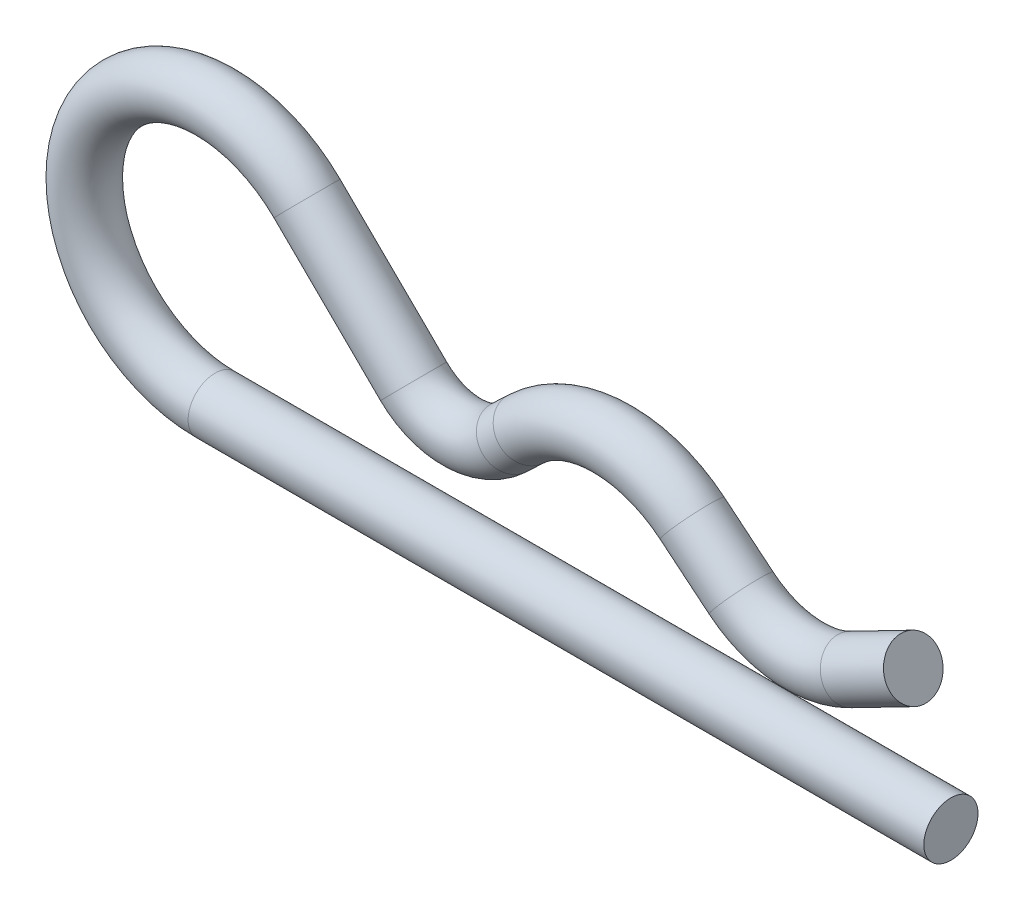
ISO-10303-21;
HEADER;
FILE_DESCRIPTION(('STEP AP214'),'2;1');
FILE_NAME('part.step','',(''),(''),'','','');
FILE_SCHEMA(('AUTOMOTIVE_DESIGN { 1 0 10303 214 1 1 1 1 }'));
ENDSEC;
DATA;
#1=APPLICATION_CONTEXT('core data for automotive mechanical design processes');
#2=APPLICATION_PROTOCOL_DEFINITION('international standard','automotive_design',2000,#1);
#3=PRODUCT_CONTEXT('',#1,'mechanical');
#4=PRODUCT('Part','Part','',(#3));
#5=PRODUCT_RELATED_PRODUCT_CATEGORY('part','',(#4));
#6=PRODUCT_DEFINITION_FORMATION('','',#4);
#7=PRODUCT_DEFINITION_CONTEXT('part definition',#1,'design');
#8=PRODUCT_DEFINITION('design','',#6,#7);
#9=PRODUCT_DEFINITION_SHAPE('','',#8);
#10=(LENGTH_UNIT() NAMED_UNIT(*) SI_UNIT(.MILLI.,.METRE.));
#11=(NAMED_UNIT(*) PLANE_ANGLE_UNIT() SI_UNIT($,.RADIAN.));
#12=(NAMED_UNIT(*) SI_UNIT($,.STERADIAN.) SOLID_ANGLE_UNIT());
#13=UNCERTAINTY_MEASURE_WITH_UNIT(LENGTH_MEASURE(1.E-05),#10,'distance_accuracy_value','');
#14=(GEOMETRIC_REPRESENTATION_CONTEXT(3) GLOBAL_UNCERTAINTY_ASSIGNED_CONTEXT((#13)) GLOBAL_UNIT_ASSIGNED_CONTEXT((#10,
#11,#12)) REPRESENTATION_CONTEXT('',''));
#15=CARTESIAN_POINT('',(0.,0.,0.));
#16=DIRECTION('',(0.,0.,1.));
#17=DIRECTION('',(1.,0.,0.));
#18=AXIS2_PLACEMENT_3D('',#15,#16,#17);
#19=CARTESIAN_POINT('',(-3.40302829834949,2.9644009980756,0.));
#20=DIRECTION('',(0.888844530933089,0.458208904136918,0.));
#21=DIRECTION('',(-0.458208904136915,0.888844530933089,0.));
#22=AXIS2_PLACEMENT_3D('',#19,#20,#21);
#23=CYLINDRICAL_SURFACE('',#22,0.9144);
#24=CARTESIAN_POINT('',(-3.40302829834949,2.9644009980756,0.));
#25=DIRECTION('',(-0.888844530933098,-0.458208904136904,0.));
#26=DIRECTION('',(0.,0.,-1.00000000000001));
#27=AXIS2_PLACEMENT_3D('',#24,#25,#26);
#28=CIRCLE('',#27,0.9144);
#29=CARTESIAN_POINT('',(-2.98404207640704,2.15164155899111,0.));
#30=VERTEX_POINT('',#29);
#31=EDGE_CURVE('E36',#30,#30,#28,.T.);
#32=ORIENTED_EDGE('',*,*,#31,.F.);
#33=EDGE_LOOP('',(#32));
#34=FACE_BOUND('',#33,.T.);
#35=CARTESIAN_POINT('',(-1.26999999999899,4.06400000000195,0.));
#36=DIRECTION('',(-0.888844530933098,-0.458208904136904,0.));
#37=DIRECTION('',(0.,0.,-1.00000000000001));
#38=AXIS2_PLACEMENT_3D('',#35,#36,#37);
#39=CIRCLE('',#38,0.9144);
#40=CARTESIAN_POINT('',(-1.26999999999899,4.06400000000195,-0.914399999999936));
#41=VERTEX_POINT('',#40);
#42=EDGE_CURVE('E10',#41,#41,#39,.T.);
#43=ORIENTED_EDGE('',*,*,#42,.T.);
#44=EDGE_LOOP('',(#43));
#45=FACE_BOUND('',#44,.T.);
#46=ADVANCED_FACE('F30',(#34,#45),#23,.T.);
#47=CARTESIAN_POINT('',(-4.9430992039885,5.95186717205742,0.));
#48=DIRECTION('',(0.,0.,1.00000000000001));
#49=DIRECTION('',(1.00000000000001,0.,0.));
#50=AXIS2_PLACEMENT_3D('',#47,#48,#49);
#51=TOROIDAL_SURFACE('',#50,3.36106717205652,0.9144);
#52=CARTESIAN_POINT('',(-7.08114967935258,3.35850782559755,0.));
#53=DIRECTION('',(-0.771588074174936,0.636122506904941,0.));
#54=DIRECTION('',(0.,0.,-1.00000000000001));
#55=AXIS2_PLACEMENT_3D('',#52,#53,#54);
#56=CIRCLE('',#55,0.9144);
#57=CARTESIAN_POINT('',(-7.66282009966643,2.65296769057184,0.));
#58=VERTEX_POINT('',#57);
#59=EDGE_CURVE('E40',#58,#58,#56,.T.);
#60=CARTESIAN_POINT('',(-4.9430992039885,5.95186717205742,0.));
#61=DIRECTION('',(0.,0.,1.00000000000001));
#62=DIRECTION('',(1.00000000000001,0.,0.));
#63=AXIS2_PLACEMENT_3D('',#60,#61,#62);
#64=CIRCLE('',#63,4.27546717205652);
#65=EDGE_CURVE('',#58,#30,#64,.T.);
#66=ORIENTED_EDGE('',*,*,#59,.F.);
#67=ORIENTED_EDGE('',*,*,#31,.T.);
#68=ORIENTED_EDGE('',*,*,#65,.T.);
#69=ORIENTED_EDGE('',*,*,#65,.F.);
#70=EDGE_LOOP('',(#66,#68,#67,#69));
#71=FACE_BOUND('',#70,.T.);
#72=ADVANCED_FACE('F86',(#71),#51,.T.);
#73=CARTESIAN_POINT('',(-8.73481211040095,4.72184135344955,0.));
#74=DIRECTION('',(0.771588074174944,-0.636122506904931,0.));
#75=DIRECTION('',(0.636122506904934,0.771588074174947,0.));
#76=AXIS2_PLACEMENT_3D('',#73,#74,#75);
#77=CYLINDRICAL_SURFACE('',#76,0.9144);
#78=CARTESIAN_POINT('',(-8.73481211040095,4.72184135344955,0.));
#79=DIRECTION('',(-0.771588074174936,0.636122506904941,0.));
#80=DIRECTION('',(0.,0.,-1.00000000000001));
#81=AXIS2_PLACEMENT_3D('',#78,#79,#80);
#82=CIRCLE('',#81,0.9144);
#83=CARTESIAN_POINT('',(-8.15314169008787,5.42738148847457,0.));
#84=VERTEX_POINT('',#83);
#85=EDGE_CURVE('E44',#84,#84,#82,.T.);
#86=ORIENTED_EDGE('',*,*,#85,.F.);
#87=EDGE_LOOP('',(#86));
#88=FACE_BOUND('',#87,.T.);
#89=ORIENTED_EDGE('',*,*,#59,.T.);
#90=EDGE_LOOP('',(#89));
#91=FACE_BOUND('',#90,.T.);
#92=ADVANCED_FACE('F91',(#88,#91),#77,.T.);
#93=CARTESIAN_POINT('',(-11.4299999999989,1.45269930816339,0.));
#94=DIRECTION('',(0.,0.,-1.00000000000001));
#95=DIRECTION('',(-1.00000000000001,0.,0.));
#96=AXIS2_PLACEMENT_3D('',#93,#94,#95);
#97=TOROIDAL_SURFACE('',#96,4.23690069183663,0.9144);
#98=CARTESIAN_POINT('',(-14.3450404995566,4.527413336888,0.));
#99=DIRECTION('',(-0.725698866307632,-0.688012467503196,0.));
#100=DIRECTION('',(0.,0.,-1.00000000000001));
#101=AXIS2_PLACEMENT_3D('',#98,#99,#100);
#102=CIRCLE('',#101,0.9144);
#103=CARTESIAN_POINT('',(-14.9741590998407,5.19099238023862,0.));
#104=VERTEX_POINT('',#103);
#105=EDGE_CURVE('E49',#104,#104,#102,.T.);
#106=CARTESIAN_POINT('',(-11.4299999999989,1.45269930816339,0.));
#107=DIRECTION('',(0.,0.,-1.00000000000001));
#108=DIRECTION('',(-1.00000000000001,0.,0.));
#109=AXIS2_PLACEMENT_3D('',#106,#107,#108);
#110=CIRCLE('',#109,5.15130069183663);
#111=EDGE_CURVE('',#104,#84,#110,.T.);
#112=ORIENTED_EDGE('',*,*,#105,.F.);
#113=ORIENTED_EDGE('',*,*,#85,.T.);
#114=ORIENTED_EDGE('',*,*,#111,.T.);
#115=ORIENTED_EDGE('',*,*,#111,.F.);
#116=EDGE_LOOP('',(#112,#114,#113,#115));
#117=FACE_BOUND('',#116,.T.);
#118=ADVANCED_FACE('F96',(#117),#97,.T.);
#119=CARTESIAN_POINT('',(-14.9119927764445,3.98990356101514,0.));
#120=DIRECTION('',(0.725698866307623,0.688012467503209,0.));
#121=DIRECTION('',(-0.688012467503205,0.725698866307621,0.));
#122=AXIS2_PLACEMENT_3D('',#119,#120,#121);
#123=CYLINDRICAL_SURFACE('',#122,0.9144);
#124=CARTESIAN_POINT('',(-14.9119927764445,3.98990356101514,0.));
#125=DIRECTION('',(-0.725698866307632,-0.688012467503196,0.));
#126=DIRECTION('',(0.,0.,-1.00000000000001));
#127=AXIS2_PLACEMENT_3D('',#124,#125,#126);
#128=CIRCLE('',#127,0.9144);
#129=CARTESIAN_POINT('',(-14.2828741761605,3.32632451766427,0.));
#130=VERTEX_POINT('',#129);
#131=EDGE_CURVE('E52',#130,#130,#128,.T.);
#132=ORIENTED_EDGE('',*,*,#131,.F.);
#133=EDGE_LOOP('',(#132));
#134=FACE_BOUND('',#133,.T.);
#135=ORIENTED_EDGE('',*,*,#105,.T.);
#136=EDGE_LOOP('',(#135));
#137=FACE_BOUND('',#136,.T.);
#138=ADVANCED_FACE('F103',(#134,#137),#123,.T.);
#139=CARTESIAN_POINT('',(-16.5099999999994,5.67544282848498,0.));
#140=DIRECTION('',(0.,0.,1.00000000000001));
#141=DIRECTION('',(1.00000000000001,0.,0.));
#142=AXIS2_PLACEMENT_3D('',#139,#140,#141);
#143=TOROIDAL_SURFACE('',#142,2.3226428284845,0.9144);
#144=CARTESIAN_POINT('',(-18.1402850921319,4.02110301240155,0.));
#145=DIRECTION('',(-0.712266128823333,0.701909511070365,0.));
#146=DIRECTION('',(0.,0.,-1.00000000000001));
#147=AXIS2_PLACEMENT_3D('',#144,#145,#146);
#148=CIRCLE('',#147,0.9144);
#149=CARTESIAN_POINT('',(-18.782111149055,3.36980686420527,0.));
#150=VERTEX_POINT('',#149);
#151=EDGE_CURVE('E55',#150,#150,#148,.T.);
#152=CARTESIAN_POINT('',(-16.5099999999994,5.67544282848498,0.));
#153=DIRECTION('',(0.,0.,1.00000000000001));
#154=DIRECTION('',(1.00000000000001,0.,0.));
#155=AXIS2_PLACEMENT_3D('',#152,#153,#154);
#156=CIRCLE('',#155,3.2370428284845);
#157=EDGE_CURVE('',#150,#130,#156,.T.);
#158=ORIENTED_EDGE('',*,*,#151,.F.);
#159=ORIENTED_EDGE('',*,*,#131,.T.);
#160=ORIENTED_EDGE('',*,*,#157,.T.);
#161=ORIENTED_EDGE('',*,*,#157,.F.);
#162=EDGE_LOOP('',(#158,#160,#159,#161));
#163=FACE_BOUND('',#162,.T.);
#164=ADVANCED_FACE('F107',(#163),#143,.T.);
#165=CARTESIAN_POINT('',(-21.7390407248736,7.56753138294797,0.));
#166=DIRECTION('',(0.712266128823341,-0.701909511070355,0.));
#167=DIRECTION('',(0.701909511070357,0.712266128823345,0.));
#168=AXIS2_PLACEMENT_3D('',#165,#166,#167);
#169=CYLINDRICAL_SURFACE('',#168,0.9144);
#170=CARTESIAN_POINT('',(-21.7390407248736,7.56753138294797,0.));
#171=DIRECTION('',(-0.712266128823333,0.701909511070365,0.));
#172=DIRECTION('',(0.,0.,-1.00000000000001));
#173=AXIS2_PLACEMENT_3D('',#170,#171,#172);
#174=CIRCLE('',#173,0.9144);
#175=CARTESIAN_POINT('',(-21.0972146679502,8.21882753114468,0.));
#176=VERTEX_POINT('',#175);
#177=EDGE_CURVE('E58',#176,#176,#174,.T.);
#178=ORIENTED_EDGE('',*,*,#177,.F.);
#179=EDGE_LOOP('',(#178));
#180=FACE_BOUND('',#179,.T.);
#181=ORIENTED_EDGE('',*,*,#151,.T.);
#182=EDGE_LOOP('',(#181));
#183=FACE_BOUND('',#182,.T.);
#184=ADVANCED_FACE('F82',(#180,#183),#169,.T.);
#185=CARTESIAN_POINT('',(-24.8411999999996,4.41960000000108,0.));
#186=DIRECTION('',(0.,0.,-1.00000000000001));
#187=DIRECTION('',(-1.00000000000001,0.,0.));
#188=AXIS2_PLACEMENT_3D('',#185,#186,#187);
#189=TOROIDAL_SURFACE('',#188,4.4196,0.9144);
#190=CARTESIAN_POINT('',(-24.8411999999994,1.88737914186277E-12,0.));
#191=DIRECTION('',(1.00000000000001,0.,0.));
#192=DIRECTION('',(0.,0.,-1.00000000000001));
#193=AXIS2_PLACEMENT_3D('',#190,#191,#192);
#194=CIRCLE('',#193,0.9144);
#195=CARTESIAN_POINT('',(-24.8411999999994,-0.914399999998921,0.));
#196=VERTEX_POINT('',#195);
#197=EDGE_CURVE('E61',#196,#196,#194,.T.);
#198=CARTESIAN_POINT('',(-24.8411999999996,4.41960000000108,0.));
#199=DIRECTION('',(0.,0.,-1.00000000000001));
#200=DIRECTION('',(-1.00000000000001,0.,0.));
#201=AXIS2_PLACEMENT_3D('',#198,#199,#200);
#202=CIRCLE('',#201,5.334);
#203=EDGE_CURVE('',#196,#176,#202,.T.);
#204=ORIENTED_EDGE('',*,*,#197,.F.);
#205=ORIENTED_EDGE('',*,*,#177,.T.);
#206=ORIENTED_EDGE('',*,*,#203,.T.);
#207=ORIENTED_EDGE('',*,*,#203,.F.);
#208=EDGE_LOOP('',(#204,#206,#205,#207));
#209=FACE_BOUND('',#208,.T.);
#210=ADVANCED_FACE('F73',(#209),#189,.T.);
#211=CARTESIAN_POINT('',(-24.8411999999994,1.88737914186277E-12,0.));
#212=DIRECTION('',(1.00000000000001,0.,0.));
#213=DIRECTION('',(0.,1.00000000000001,0.));
#214=AXIS2_PLACEMENT_3D('',#211,#212,#213);
#215=CYLINDRICAL_SURFACE('',#214,0.9144);
#216=ORIENTED_EDGE('',*,*,#197,.T.);
#217=EDGE_LOOP('',(#216));
#218=FACE_BOUND('',#217,.T.);
#219=CARTESIAN_POINT('',(9.43689570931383E-13,6.66133814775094E-13,0.));
#220=DIRECTION('',(1.00000000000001,0.,0.));
#221=DIRECTION('',(0.,0.,-1.00000000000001));
#222=AXIS2_PLACEMENT_3D('',#219,#220,#221);
#223=CIRCLE('',#222,0.9144);
#224=CARTESIAN_POINT('',(9.43841849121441E-13,6.64858484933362E-13,-0.914399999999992));
#225=VERTEX_POINT('',#224);
#226=EDGE_CURVE('E64',#225,#225,#223,.T.);
#227=ORIENTED_EDGE('',*,*,#226,.F.);
#228=EDGE_LOOP('',(#227));
#229=FACE_BOUND('',#228,.T.);
#230=ADVANCED_FACE('F70',(#218,#229),#215,.T.);
#231=CARTESIAN_POINT('',(-1.26999999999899,4.06400000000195,0.));
#232=DIRECTION('',(-0.888844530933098,-0.458208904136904,0.));
#233=DIRECTION('',(0.,0.,-1.00000000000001));
#234=AXIS2_PLACEMENT_3D('',#231,#232,#233);
#235=PLANE('',#234);
#236=ORIENTED_EDGE('',*,*,#42,.F.);
#237=EDGE_LOOP('',(#236));
#238=FACE_BOUND('',#237,.T.);
#239=ADVANCED_FACE('F72',(#238),#235,.F.);
#240=CARTESIAN_POINT('',(9.43689570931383E-13,6.66133814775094E-13,0.));
#241=DIRECTION('',(1.00000000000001,0.,0.));
#242=DIRECTION('',(0.,0.,-1.00000000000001));
#243=AXIS2_PLACEMENT_3D('',#240,#241,#242);
#244=PLANE('',#243);
#245=ORIENTED_EDGE('',*,*,#226,.T.);
#246=EDGE_LOOP('',(#245));
#247=FACE_BOUND('',#246,.T.);
#248=ADVANCED_FACE('F68',(#247),#244,.T.);
#249=CLOSED_SHELL('',(#46,#72,#92,#118,#138,#164,#184,#210,#230,#239,#248));
#250=MANIFOLD_SOLID_BREP('B2',#249);
#251=ADVANCED_BREP_SHAPE_REPRESENTATION('',(#18,#250),#14);
#252=SHAPE_DEFINITION_REPRESENTATION(#9,#251);
ENDSEC;
END-ISO-10303-21;
